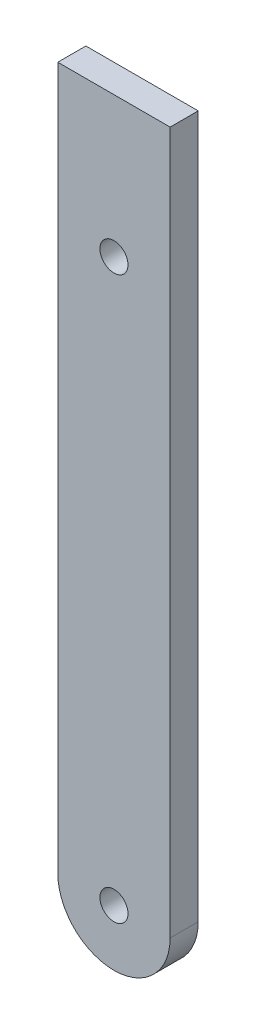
from build123d import *

# Parameters (mm, degrees)
SKETCH1_R           = 2.5
BOSS_EXTRUDE1_DEPTH = 5


with BuildPart() as part:
    # Sketch1 → Boss-Extrude1 (new body)
    with BuildSketch(Plane.XY):
        with BuildLine():
            Line((-10, 0), (-10, 125))
            Line((-10, 125), (10, 125))
            Line((10, 125), (10, 0))
            ThreePointArc((10, 0), (0, -10), (-10, 0))
        make_face()
        Circle(SKETCH1_R, mode=Mode.SUBTRACT)
        with Locations((0, 100)):
            Circle(SKETCH1_R, mode=Mode.SUBTRACT)
    extrude(amount=BOSS_EXTRUDE1_DEPTH)


solid = part.part
